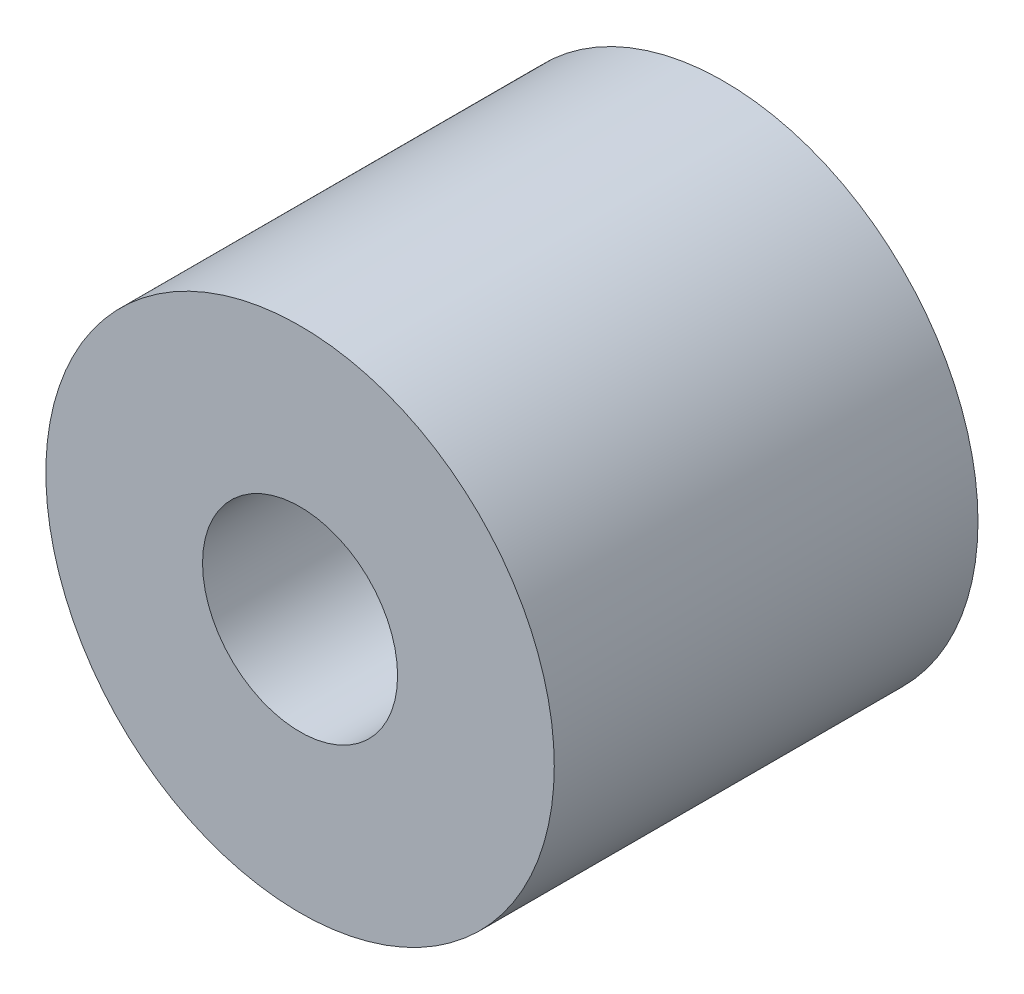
from build123d import *

# Parameters (mm, degrees)
ESQUISSE1_R           = 15
EXTRUSION1_DEPTH      = 25
TROU_TARAUD_1_2_201_D = 11.50874


with BuildPart() as part:
    # Esquisse1 → Extrusion1 (new body)
    with BuildSketch(Plane.XY):
        Circle(ESQUISSE1_R)
    extrude(amount=EXTRUSION1_DEPTH)

    # Trou taraud_ 1_2-201 (through all)
    with Locations(Plane.XY.offset(25)):
        with Locations((0, 0)):
            Hole(TROU_TARAUD_1_2_201_D / 2)


solid = part.part
